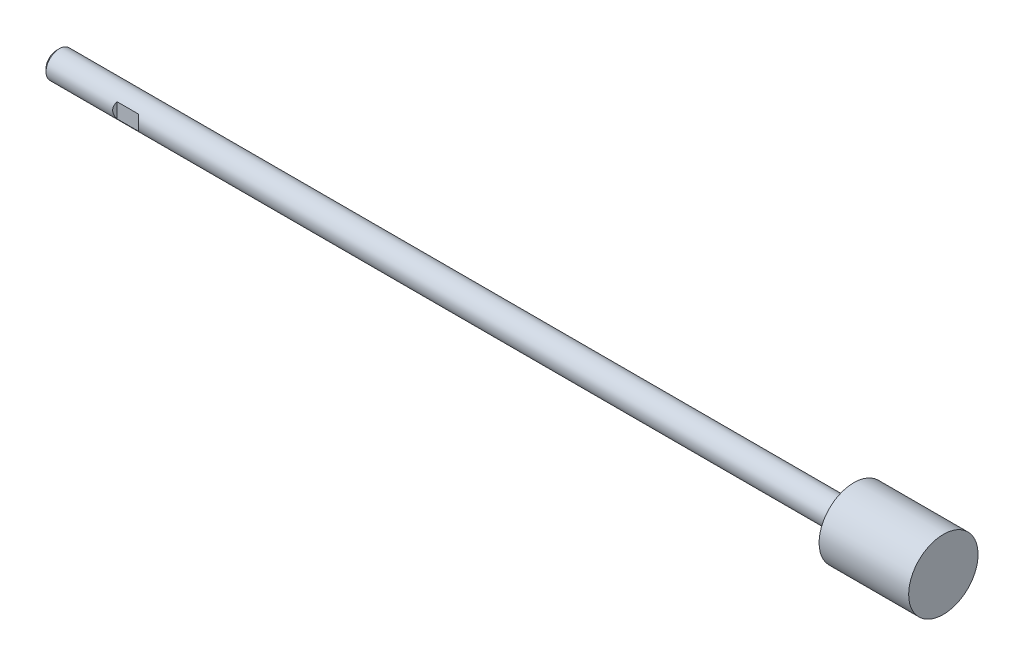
ISO-10303-21;
HEADER;
FILE_DESCRIPTION(('STEP AP214'),'2;1');
FILE_NAME('part.step','',(''),(''),'','','');
FILE_SCHEMA(('AUTOMOTIVE_DESIGN { 1 0 10303 214 1 1 1 1 }'));
ENDSEC;
DATA;
#1=APPLICATION_CONTEXT('core data for automotive mechanical design processes');
#2=APPLICATION_PROTOCOL_DEFINITION('international standard','automotive_design',2000,#1);
#3=PRODUCT_CONTEXT('',#1,'mechanical');
#4=PRODUCT('Part','Part','',(#3));
#5=PRODUCT_RELATED_PRODUCT_CATEGORY('part','',(#4));
#6=PRODUCT_DEFINITION_FORMATION('','',#4);
#7=PRODUCT_DEFINITION_CONTEXT('part definition',#1,'design');
#8=PRODUCT_DEFINITION('design','',#6,#7);
#9=PRODUCT_DEFINITION_SHAPE('','',#8);
#10=(LENGTH_UNIT() NAMED_UNIT(*) SI_UNIT(.MILLI.,.METRE.));
#11=(NAMED_UNIT(*) PLANE_ANGLE_UNIT() SI_UNIT($,.RADIAN.));
#12=(NAMED_UNIT(*) SI_UNIT($,.STERADIAN.) SOLID_ANGLE_UNIT());
#13=UNCERTAINTY_MEASURE_WITH_UNIT(LENGTH_MEASURE(1.E-05),#10,'distance_accuracy_value','');
#14=(GEOMETRIC_REPRESENTATION_CONTEXT(3) GLOBAL_UNCERTAINTY_ASSIGNED_CONTEXT((#13)) GLOBAL_UNIT_ASSIGNED_CONTEXT((#10,
#11,#12)) REPRESENTATION_CONTEXT('',''));
#15=CARTESIAN_POINT('',(0.,0.,0.));
#16=DIRECTION('',(0.,0.,1.));
#17=DIRECTION('',(1.,0.,0.));
#18=AXIS2_PLACEMENT_3D('',#15,#16,#17);
#19=CARTESIAN_POINT('',(0.,0.,0.));
#20=DIRECTION('',(1.,0.,0.));
#21=DIRECTION('',(0.,0.,-1.));
#22=AXIS2_PLACEMENT_3D('',#19,#20,#21);
#23=PLANE('',#22);
#24=CARTESIAN_POINT('',(0.,0.,0.));
#25=DIRECTION('',(-1.,0.,0.));
#26=DIRECTION('',(0.,0.,1.));
#27=AXIS2_PLACEMENT_3D('',#24,#25,#26);
#28=CIRCLE('',#27,2.3865);
#29=CARTESIAN_POINT('',(0.,0.,2.3865));
#30=VERTEX_POINT('',#29);
#31=EDGE_CURVE('E60',#30,#30,#28,.T.);
#32=ORIENTED_EDGE('',*,*,#31,.T.);
#33=EDGE_LOOP('',(#32));
#34=FACE_BOUND('',#33,.T.);
#35=ADVANCED_FACE('F16',(#34),#23,.F.);
#36=CARTESIAN_POINT('',(0.613499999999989,0.,0.));
#37=DIRECTION('',(1.,0.,0.));
#38=DIRECTION('',(0.,0.,-1.));
#39=AXIS2_PLACEMENT_3D('',#36,#37,#38);
#40=CONICAL_SURFACE('',#39,3.,0.785398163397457);
#41=ORIENTED_EDGE('',*,*,#31,.F.);
#42=EDGE_LOOP('',(#41));
#43=FACE_BOUND('',#42,.T.);
#44=CARTESIAN_POINT('',(0.613499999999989,0.,0.));
#45=DIRECTION('',(-1.,0.,0.));
#46=DIRECTION('',(0.,0.,1.));
#47=AXIS2_PLACEMENT_3D('',#44,#45,#46);
#48=CIRCLE('',#47,3.);
#49=CARTESIAN_POINT('',(0.613499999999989,0.,3.));
#50=VERTEX_POINT('',#49);
#51=EDGE_CURVE('E105',#50,#50,#48,.T.);
#52=ORIENTED_EDGE('',*,*,#51,.T.);
#53=EDGE_LOOP('',(#52));
#54=FACE_BOUND('',#53,.T.);
#55=ADVANCED_FACE('F111',(#43,#54),#40,.T.);
#56=CARTESIAN_POINT('',(198.,0.,0.));
#57=DIRECTION('',(-1.,0.,0.));
#58=DIRECTION('',(0.,0.,1.));
#59=AXIS2_PLACEMENT_3D('',#56,#57,#58);
#60=CYLINDRICAL_SURFACE('',#59,3.);
#61=DIRECTION('',(-1.,0.,0.));
#62=VECTOR('',#61,1.);
#63=CARTESIAN_POINT('',(198.,-1.6583123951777,-2.5));
#64=LINE('',#63,#62);
#65=CARTESIAN_POINT('',(16.,-1.65831239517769,-2.5));
#66=VERTEX_POINT('',#65);
#67=CARTESIAN_POINT('',(20.8,-1.6583123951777,-2.5));
#68=VERTEX_POINT('',#67);
#69=EDGE_CURVE('E81',#66,#68,#64,.F.);
#70=ORIENTED_EDGE('',*,*,#69,.T.);
#71=CARTESIAN_POINT('',(18.3,0.,0.));
#72=DIRECTION('',(0.707106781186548,0.,0.707106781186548));
#73=DIRECTION('',(-0.707106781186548,0.,0.707106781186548));
#74=AXIS2_PLACEMENT_3D('',#71,#72,#73);
#75=ELLIPSE('',#74,4.24264068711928,3.);
#76=CARTESIAN_POINT('',(20.8,1.6583123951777,-2.5));
#77=VERTEX_POINT('',#76);
#78=EDGE_CURVE('E11',#68,#77,#75,.T.);
#79=ORIENTED_EDGE('',*,*,#78,.T.);
#80=DIRECTION('',(-1.,0.,0.));
#81=VECTOR('',#80,1.);
#82=CARTESIAN_POINT('',(198.,1.6583123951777,-2.5));
#83=LINE('',#82,#81);
#84=CARTESIAN_POINT('',(16.,1.65831239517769,-2.5));
#85=VERTEX_POINT('',#84);
#86=EDGE_CURVE('E23',#77,#85,#83,.T.);
#87=ORIENTED_EDGE('',*,*,#86,.T.);
#88=CARTESIAN_POINT('',(18.5,0.,0.));
#89=DIRECTION('',(-0.707106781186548,0.,0.707106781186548));
#90=DIRECTION('',(-0.707106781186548,0.,-0.707106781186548));
#91=AXIS2_PLACEMENT_3D('',#88,#89,#90);
#92=ELLIPSE('',#91,4.24264068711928,3.);
#93=EDGE_CURVE('E78',#85,#66,#92,.T.);
#94=ORIENTED_EDGE('',*,*,#93,.T.);
#95=EDGE_LOOP('',(#70,#79,#87,#94));
#96=FACE_BOUND('',#95,.T.);
#97=DIRECTION('',(-1.,0.,0.));
#98=VECTOR('',#97,1.);
#99=CARTESIAN_POINT('',(198.,-1.6583123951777,2.5));
#100=LINE('',#99,#98);
#101=CARTESIAN_POINT('',(20.8,-1.65831239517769,2.5));
#102=VERTEX_POINT('',#101);
#103=CARTESIAN_POINT('',(16.,-1.6583123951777,2.5));
#104=VERTEX_POINT('',#103);
#105=EDGE_CURVE('E66',#102,#104,#100,.T.);
#106=ORIENTED_EDGE('',*,*,#105,.T.);
#107=CARTESIAN_POINT('',(18.5,0.,0.));
#108=DIRECTION('',(-0.707106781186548,0.,-0.707106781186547));
#109=DIRECTION('',(-0.707106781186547,0.,0.707106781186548));
#110=AXIS2_PLACEMENT_3D('',#107,#108,#109);
#111=ELLIPSE('',#110,4.24264068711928,3.);
#112=CARTESIAN_POINT('',(16.,1.6583123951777,2.5));
#113=VERTEX_POINT('',#112);
#114=EDGE_CURVE('E72',#104,#113,#111,.T.);
#115=ORIENTED_EDGE('',*,*,#114,.T.);
#116=DIRECTION('',(-1.,0.,0.));
#117=VECTOR('',#116,1.);
#118=CARTESIAN_POINT('',(198.,1.6583123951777,2.5));
#119=LINE('',#118,#117);
#120=CARTESIAN_POINT('',(20.8,1.65831239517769,2.5));
#121=VERTEX_POINT('',#120);
#122=EDGE_CURVE('E59',#113,#121,#119,.F.);
#123=ORIENTED_EDGE('',*,*,#122,.T.);
#124=CARTESIAN_POINT('',(18.3,0.,0.));
#125=DIRECTION('',(0.707106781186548,0.,-0.707106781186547));
#126=DIRECTION('',(-0.707106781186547,0.,-0.707106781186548));
#127=AXIS2_PLACEMENT_3D('',#124,#125,#126);
#128=ELLIPSE('',#127,4.24264068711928,3.);
#129=EDGE_CURVE('E54',#121,#102,#128,.T.);
#130=ORIENTED_EDGE('',*,*,#129,.T.);
#131=EDGE_LOOP('',(#106,#115,#123,#130));
#132=FACE_BOUND('',#131,.T.);
#133=ORIENTED_EDGE('',*,*,#51,.F.);
#134=EDGE_LOOP('',(#133));
#135=FACE_BOUND('',#134,.T.);
#136=CARTESIAN_POINT('',(178.,0.,0.));
#137=DIRECTION('',(-1.,0.,0.));
#138=DIRECTION('',(0.,0.,1.));
#139=AXIS2_PLACEMENT_3D('',#136,#137,#138);
#140=CIRCLE('',#139,3.);
#141=CARTESIAN_POINT('',(178.,0.,3.));
#142=VERTEX_POINT('',#141);
#143=EDGE_CURVE('E102',#142,#142,#140,.T.);
#144=ORIENTED_EDGE('',*,*,#143,.T.);
#145=EDGE_LOOP('',(#144));
#146=FACE_BOUND('',#145,.T.);
#147=ADVANCED_FACE('F70',(#96,#132,#135,#146),#60,.T.);
#148=CARTESIAN_POINT('',(178.,3.,0.));
#149=DIRECTION('',(1.,0.,0.));
#150=DIRECTION('',(0.,0.,-1.));
#151=AXIS2_PLACEMENT_3D('',#148,#149,#150);
#152=PLANE('',#151);
#153=ORIENTED_EDGE('',*,*,#143,.F.);
#154=EDGE_LOOP('',(#153));
#155=FACE_BOUND('',#154,.T.);
#156=CARTESIAN_POINT('',(178.,0.,0.));
#157=DIRECTION('',(-1.,0.,0.));
#158=DIRECTION('',(0.,0.,1.));
#159=AXIS2_PLACEMENT_3D('',#156,#157,#158);
#160=CIRCLE('',#159,7.75);
#161=CARTESIAN_POINT('',(178.,0.,7.75));
#162=VERTEX_POINT('',#161);
#163=EDGE_CURVE('E95',#162,#162,#160,.T.);
#164=ORIENTED_EDGE('',*,*,#163,.T.);
#165=EDGE_LOOP('',(#164));
#166=FACE_BOUND('',#165,.T.);
#167=ADVANCED_FACE('F117',(#155,#166),#152,.F.);
#168=CARTESIAN_POINT('',(198.,0.,0.));
#169=DIRECTION('',(-1.,0.,0.));
#170=DIRECTION('',(0.,0.,1.));
#171=AXIS2_PLACEMENT_3D('',#168,#169,#170);
#172=CYLINDRICAL_SURFACE('',#171,7.75);
#173=ORIENTED_EDGE('',*,*,#163,.F.);
#174=EDGE_LOOP('',(#173));
#175=FACE_BOUND('',#174,.T.);
#176=CARTESIAN_POINT('',(198.,0.,0.));
#177=DIRECTION('',(-1.,0.,0.));
#178=DIRECTION('',(0.,0.,1.));
#179=AXIS2_PLACEMENT_3D('',#176,#177,#178);
#180=CIRCLE('',#179,7.75);
#181=CARTESIAN_POINT('',(198.,0.,7.75));
#182=VERTEX_POINT('',#181);
#183=EDGE_CURVE('E92',#182,#182,#180,.T.);
#184=ORIENTED_EDGE('',*,*,#183,.T.);
#185=EDGE_LOOP('',(#184));
#186=FACE_BOUND('',#185,.T.);
#187=ADVANCED_FACE('F123',(#175,#186),#172,.T.);
#188=CARTESIAN_POINT('',(198.,7.75,0.));
#189=DIRECTION('',(-1.,0.,0.));
#190=DIRECTION('',(0.,0.,1.));
#191=AXIS2_PLACEMENT_3D('',#188,#189,#190);
#192=PLANE('',#191);
#193=ORIENTED_EDGE('',*,*,#183,.F.);
#194=EDGE_LOOP('',(#193));
#195=FACE_BOUND('',#194,.T.);
#196=ADVANCED_FACE('F129',(#195),#192,.F.);
#197=CARTESIAN_POINT('',(30.3,-2.5,12.));
#198=DIRECTION('',(0.707106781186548,0.,-0.707106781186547));
#199=DIRECTION('',(-0.707106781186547,0.,-0.707106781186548));
#200=AXIS2_PLACEMENT_3D('',#197,#198,#199);
#201=PLANE('',#200);
#202=DIRECTION('',(0.,1.,0.));
#203=VECTOR('',#202,1.);
#204=CARTESIAN_POINT('',(20.8,-2.5,2.5));
#205=LINE('',#204,#203);
#206=EDGE_CURVE('E36',#102,#121,#205,.T.);
#207=ORIENTED_EDGE('',*,*,#206,.F.);
#208=ORIENTED_EDGE('',*,*,#129,.F.);
#209=EDGE_LOOP('',(#207,#208));
#210=FACE_BOUND('',#209,.T.);
#211=ADVANCED_FACE('F55',(#210),#201,.F.);
#212=CARTESIAN_POINT('',(20.8,-2.5,2.5));
#213=DIRECTION('',(0.,0.,-1.));
#214=DIRECTION('',(-1.,0.,0.));
#215=AXIS2_PLACEMENT_3D('',#212,#213,#214);
#216=PLANE('',#215);
#217=ORIENTED_EDGE('',*,*,#206,.T.);
#218=ORIENTED_EDGE('',*,*,#122,.F.);
#219=DIRECTION('',(0.,1.,0.));
#220=VECTOR('',#219,1.);
#221=CARTESIAN_POINT('',(16.,-2.5,2.5));
#222=LINE('',#221,#220);
#223=EDGE_CURVE('E67',#104,#113,#222,.T.);
#224=ORIENTED_EDGE('',*,*,#223,.F.);
#225=ORIENTED_EDGE('',*,*,#105,.F.);
#226=EDGE_LOOP('',(#217,#218,#224,#225));
#227=FACE_BOUND('',#226,.T.);
#228=ADVANCED_FACE('F63',(#227),#216,.F.);
#229=CARTESIAN_POINT('',(16.,-2.5,2.5));
#230=DIRECTION('',(-0.707106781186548,0.,-0.707106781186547));
#231=DIRECTION('',(-0.707106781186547,0.,0.707106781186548));
#232=AXIS2_PLACEMENT_3D('',#229,#230,#231);
#233=PLANE('',#232);
#234=ORIENTED_EDGE('',*,*,#223,.T.);
#235=ORIENTED_EDGE('',*,*,#114,.F.);
#236=EDGE_LOOP('',(#234,#235));
#237=FACE_BOUND('',#236,.T.);
#238=ADVANCED_FACE('F194',(#237),#233,.F.);
#239=CARTESIAN_POINT('',(20.8,-2.5,-2.5));
#240=DIRECTION('',(0.707106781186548,0.,0.707106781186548));
#241=DIRECTION('',(0.707106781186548,0.,-0.707106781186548));
#242=AXIS2_PLACEMENT_3D('',#239,#240,#241);
#243=PLANE('',#242);
#244=DIRECTION('',(0.,1.,0.));
#245=VECTOR('',#244,1.);
#246=CARTESIAN_POINT('',(20.8,-2.5,-2.5));
#247=LINE('',#246,#245);
#248=EDGE_CURVE('E89',#68,#77,#247,.T.);
#249=ORIENTED_EDGE('',*,*,#248,.T.);
#250=ORIENTED_EDGE('',*,*,#78,.F.);
#251=EDGE_LOOP('',(#249,#250));
#252=FACE_BOUND('',#251,.T.);
#253=ADVANCED_FACE('F91',(#252),#243,.F.);
#254=CARTESIAN_POINT('',(16.,-2.5,-2.5));
#255=DIRECTION('',(0.,0.,1.));
#256=DIRECTION('',(1.,0.,0.));
#257=AXIS2_PLACEMENT_3D('',#254,#255,#256);
#258=PLANE('',#257);
#259=ORIENTED_EDGE('',*,*,#248,.F.);
#260=ORIENTED_EDGE('',*,*,#69,.F.);
#261=DIRECTION('',(0.,1.,0.));
#262=VECTOR('',#261,1.);
#263=CARTESIAN_POINT('',(16.,-2.5,-2.5));
#264=LINE('',#263,#262);
#265=EDGE_CURVE('E29',#66,#85,#264,.T.);
#266=ORIENTED_EDGE('',*,*,#265,.T.);
#267=ORIENTED_EDGE('',*,*,#86,.F.);
#268=EDGE_LOOP('',(#259,#260,#266,#267));
#269=FACE_BOUND('',#268,.T.);
#270=ADVANCED_FACE('F88',(#269),#258,.F.);
#271=CARTESIAN_POINT('',(14.4,-2.5,-4.1));
#272=DIRECTION('',(-0.707106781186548,0.,0.707106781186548));
#273=DIRECTION('',(0.707106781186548,0.,0.707106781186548));
#274=AXIS2_PLACEMENT_3D('',#271,#272,#273);
#275=PLANE('',#274);
#276=ORIENTED_EDGE('',*,*,#265,.F.);
#277=ORIENTED_EDGE('',*,*,#93,.F.);
#278=EDGE_LOOP('',(#276,#277));
#279=FACE_BOUND('',#278,.T.);
#280=ADVANCED_FACE('F223',(#279),#275,.F.);
#281=CLOSED_SHELL('',(#35,#55,#147,#167,#187,#196,#211,#228,#238,#253,#270,#280));
#282=MANIFOLD_SOLID_BREP('B1',#281);
#283=ADVANCED_BREP_SHAPE_REPRESENTATION('',(#18,#282),#14);
#284=SHAPE_DEFINITION_REPRESENTATION(#9,#283);
ENDSEC;
END-ISO-10303-21;
